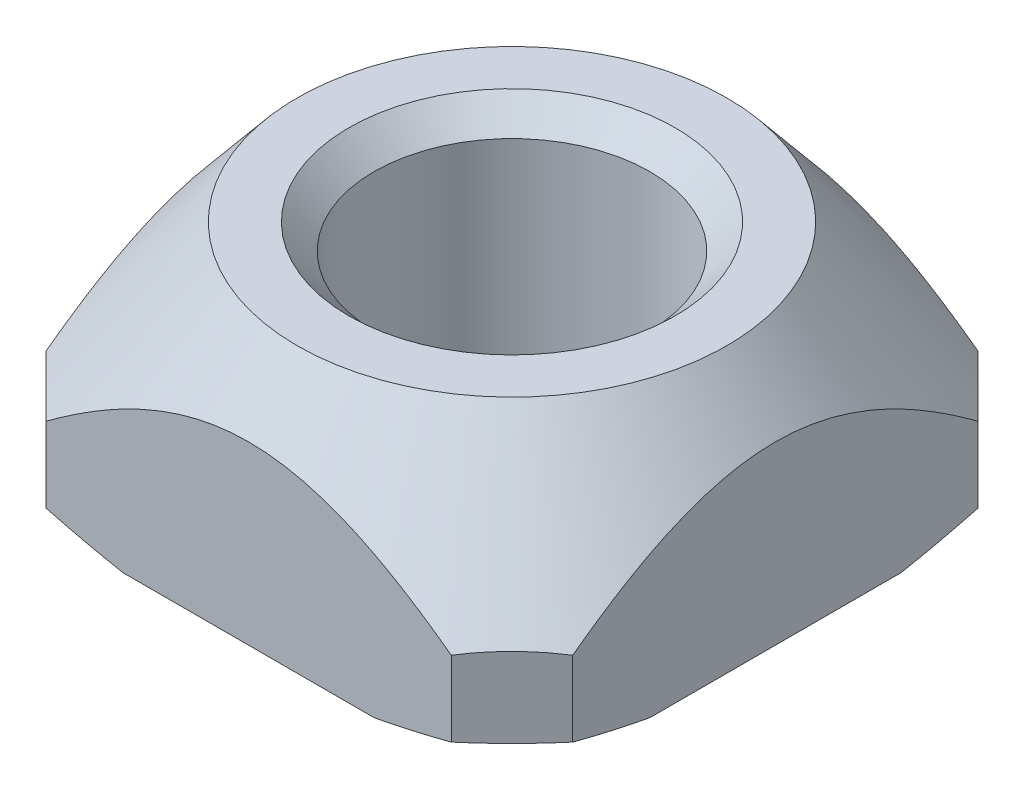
ISO-10303-21;
HEADER;
FILE_DESCRIPTION(('STEP AP214'),'2;1');
FILE_NAME('part.step','',(''),(''),'','','');
FILE_SCHEMA(('AUTOMOTIVE_DESIGN { 1 0 10303 214 1 1 1 1 }'));
ENDSEC;
DATA;
#1=APPLICATION_CONTEXT('core data for automotive mechanical design processes');
#2=APPLICATION_PROTOCOL_DEFINITION('international standard','automotive_design',2000,#1);
#3=PRODUCT_CONTEXT('',#1,'mechanical');
#4=PRODUCT('Part','Part','',(#3));
#5=PRODUCT_RELATED_PRODUCT_CATEGORY('part','',(#4));
#6=PRODUCT_DEFINITION_FORMATION('','',#4);
#7=PRODUCT_DEFINITION_CONTEXT('part definition',#1,'design');
#8=PRODUCT_DEFINITION('design','',#6,#7);
#9=PRODUCT_DEFINITION_SHAPE('','',#8);
#10=(LENGTH_UNIT() NAMED_UNIT(*) SI_UNIT(.MILLI.,.METRE.));
#11=(NAMED_UNIT(*) PLANE_ANGLE_UNIT() SI_UNIT($,.RADIAN.));
#12=(NAMED_UNIT(*) SI_UNIT($,.STERADIAN.) SOLID_ANGLE_UNIT());
#13=UNCERTAINTY_MEASURE_WITH_UNIT(LENGTH_MEASURE(1.E-05),#10,'distance_accuracy_value','');
#14=(GEOMETRIC_REPRESENTATION_CONTEXT(3) GLOBAL_UNCERTAINTY_ASSIGNED_CONTEXT((#13)) GLOBAL_UNIT_ASSIGNED_CONTEXT((#10,
#11,#12)) REPRESENTATION_CONTEXT('',''));
#15=CARTESIAN_POINT('',(0.,0.,0.));
#16=DIRECTION('',(0.,0.,1.));
#17=DIRECTION('',(1.,0.,0.));
#18=AXIS2_PLACEMENT_3D('',#15,#16,#17);
#19=CARTESIAN_POINT('',(0.,5.8,0.));
#20=DIRECTION('',(0.,-1.,0.));
#21=DIRECTION('',(0.,0.,-1.));
#22=AXIS2_PLACEMENT_3D('',#19,#20,#21);
#23=PLANE('',#22);
#24=CARTESIAN_POINT('',(0.,5.8,0.));
#25=DIRECTION('',(0.,-1.,0.));
#26=DIRECTION('',(0.,0.,-1.));
#27=AXIS2_PLACEMENT_3D('',#24,#25,#26);
#28=CIRCLE('',#27,5.3);
#29=CARTESIAN_POINT('',(0.,5.8,-5.3));
#30=VERTEX_POINT('',#29);
#31=EDGE_CURVE('E445',#30,#30,#28,.T.);
#32=ORIENTED_EDGE('',*,*,#31,.F.);
#33=EDGE_LOOP('',(#32));
#34=FACE_BOUND('',#33,.T.);
#35=CARTESIAN_POINT('',(0.,5.80000000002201,0.));
#36=DIRECTION('',(0.,1.,0.));
#37=DIRECTION('',(0.,0.,1.));
#38=AXIS2_PLACEMENT_3D('',#35,#36,#37);
#39=CIRCLE('',#38,4.02499999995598);
#40=CARTESIAN_POINT('',(0.,5.80000000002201,4.02499999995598));
#41=VERTEX_POINT('',#40);
#42=EDGE_CURVE('E19',#41,#41,#39,.F.);
#43=ORIENTED_EDGE('',*,*,#42,.T.);
#44=EDGE_LOOP('',(#43));
#45=FACE_BOUND('',#44,.T.);
#46=ADVANCED_FACE('F16',(#34,#45),#23,.F.);
#47=CARTESIAN_POINT('',(0.,5.80000000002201,0.));
#48=DIRECTION('',(0.,1.,0.));
#49=DIRECTION('',(0.,0.,1.));
#50=AXIS2_PLACEMENT_3D('',#47,#48,#49);
#51=CONICAL_SURFACE('',#50,4.02499999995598,0.785398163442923);
#52=ORIENTED_EDGE('',*,*,#42,.F.);
#53=EDGE_LOOP('',(#52));
#54=FACE_BOUND('',#53,.T.);
#55=CARTESIAN_POINT('',(0.,5.175,0.));
#56=DIRECTION('',(0.,1.,0.));
#57=DIRECTION('',(0.,0.,1.));
#58=AXIS2_PLACEMENT_3D('',#55,#56,#57);
#59=CIRCLE('',#58,3.4);
#60=CARTESIAN_POINT('',(0.,5.175,3.4));
#61=VERTEX_POINT('',#60);
#62=EDGE_CURVE('E147',#61,#61,#59,.F.);
#63=ORIENTED_EDGE('',*,*,#62,.T.);
#64=EDGE_LOOP('',(#63));
#65=FACE_BOUND('',#64,.T.);
#66=ADVANCED_FACE('F355',(#54,#65),#51,.F.);
#67=CARTESIAN_POINT('',(5.00093362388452,37.1474583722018,-6.5));
#68=DIRECTION('',(0.707106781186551,0.,-0.707106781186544));
#69=DIRECTION('',(-0.707106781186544,0.,-0.707106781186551));
#70=AXIS2_PLACEMENT_3D('',#67,#68,#69);
#71=PLANE('',#70);
#72=DIRECTION('',(0.,1.,0.));
#73=VECTOR('',#72,1.);
#74=CARTESIAN_POINT('',(5.00093362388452,5.8,-6.5));
#75=LINE('',#74,#73);
#76=CARTESIAN_POINT('',(5.00093356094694,0.429511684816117,-6.50000006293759));
#77=VERTEX_POINT('',#76);
#78=CARTESIAN_POINT('',(5.00093364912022,2.28669481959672,-6.49999997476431));
#79=VERTEX_POINT('',#78);
#80=EDGE_CURVE('E108',#77,#79,#75,.T.);
#81=ORIENTED_EDGE('',*,*,#80,.T.);
#82=CARTESIAN_POINT('',(6.50000003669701,2.28669480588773,-5.0009335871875));
#83=CARTESIAN_POINT('',(6.43784742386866,2.30045539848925,-5.06308620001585));
#84=CARTESIAN_POINT('',(6.37551621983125,2.31256643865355,-5.12541740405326));
#85=CARTESIAN_POINT('',(6.25056780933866,2.33340084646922,-5.25036581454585));
#86=CARTESIAN_POINT('',(6.18795058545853,2.34212400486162,-5.31298303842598));
#87=CARTESIAN_POINT('',(6.00058150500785,2.36298820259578,-5.50035211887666));
#88=CARTESIAN_POINT('',(5.87552418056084,2.36999999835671,-5.62540944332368));
#89=CARTESIAN_POINT('',(5.62540953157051,2.3700000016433,-5.87552409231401));
#90=CARTESIAN_POINT('',(5.5003522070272,2.36298820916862,-6.00058141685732));
#91=CARTESIAN_POINT('',(5.31298312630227,2.34212401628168,-6.18795049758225));
#92=CARTESIAN_POINT('',(5.25036590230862,2.33340085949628,-6.25056772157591));
#93=CARTESIAN_POINT('',(5.12541749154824,2.31256645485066,-6.37551613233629));
#94=CARTESIAN_POINT('',(5.06308628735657,2.30045541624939,-6.43784733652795));
#95=CARTESIAN_POINT('',(5.00093367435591,2.28669482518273,-6.49999994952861));
#96=B_SPLINE_CURVE_WITH_KNOTS('',3,(#82,#83,#84,#85,#86,#87,#88,#89,#90,#91,#92,#93,#94,#95),
.UNSPECIFIED.,.F.,.F.,(4,2,2,2,2,2,4),(0.,0.26687453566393,0.533765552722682,1.06417199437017,
1.59457843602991,1.86146945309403,2.12834398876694),.UNSPECIFIED.);
#97=CARTESIAN_POINT('',(6.5000000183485,2.28669481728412,-5.00093359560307));
#98=VERTEX_POINT('',#97);
#99=EDGE_CURVE('E101',#98,#79,#96,.T.);
#100=ORIENTED_EDGE('',*,*,#99,.F.);
#101=DIRECTION('',(0.,1.,0.));
#102=VECTOR('',#101,1.);
#103=CARTESIAN_POINT('',(6.5,5.8,-5.00093362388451));
#104=LINE('',#103,#102);
#105=CARTESIAN_POINT('',(6.50000003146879,0.429511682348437,-5.00093359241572));
#106=VERTEX_POINT('',#105);
#107=EDGE_CURVE('E106',#98,#106,#104,.F.);
#108=ORIENTED_EDGE('',*,*,#107,.T.);
#109=CARTESIAN_POINT('',(5.00093349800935,0.429511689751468,-6.50000012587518));
#110=CARTESIAN_POINT('',(5.12577543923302,0.419709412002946,-6.37515818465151));
#111=CARTESIAN_POINT('',(5.25071389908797,0.412329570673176,-6.25021972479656));
#112=CARTESIAN_POINT('',(5.50059054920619,0.402476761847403,-6.00034307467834));
#113=CARTESIAN_POINT('',(5.62552866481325,0.400000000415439,-5.87540495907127));
#114=CARTESIAN_POINT('',(5.8754048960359,0.399999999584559,-5.62552872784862));
#115=CARTESIAN_POINT('',(6.00034301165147,0.40247676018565,-5.50059061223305));
#116=CARTESIAN_POINT('',(6.25021966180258,0.412329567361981,-5.25071396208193));
#117=CARTESIAN_POINT('',(6.37515812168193,0.419709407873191,-5.12577550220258));
#118=CARTESIAN_POINT('',(6.50000006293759,0.429511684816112,-5.00093356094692));
#119=B_SPLINE_CURVE_WITH_KNOTS('',3,(#109,#110,#111,#112,#113,#114,#115,#116,#117,#118),
.UNSPECIFIED.,.F.,.F.,(4,2,2,2,4),(0.,0.530461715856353,1.06051280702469,1.59056389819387,
2.12102561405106),.UNSPECIFIED.);
#120=EDGE_CURVE('E138',#77,#106,#119,.T.);
#121=ORIENTED_EDGE('',*,*,#120,.F.);
#122=EDGE_LOOP('',(#81,#100,#108,#121));
#123=FACE_BOUND('',#122,.T.);
#124=ADVANCED_FACE('F103',(#123),#71,.T.);
#125=CARTESIAN_POINT('',(6.50000000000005,29.8974583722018,5.00093362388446));
#126=DIRECTION('',(0.707106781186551,0.,0.707106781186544));
#127=DIRECTION('',(0.707106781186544,0.,-0.707106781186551));
#128=AXIS2_PLACEMENT_3D('',#125,#126,#127);
#129=PLANE('',#128);
#130=DIRECTION('',(0.,1.,0.));
#131=VECTOR('',#130,1.);
#132=CARTESIAN_POINT('',(6.5,5.8,5.00093362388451));
#133=LINE('',#132,#131);
#134=CARTESIAN_POINT('',(6.50000006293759,0.429511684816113,5.00093356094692));
#135=VERTEX_POINT('',#134);
#136=CARTESIAN_POINT('',(6.5,2.28669481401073,5.00093362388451));
#137=VERTEX_POINT('',#136);
#138=EDGE_CURVE('E120',#135,#137,#133,.T.);
#139=ORIENTED_EDGE('',*,*,#138,.T.);
#140=CARTESIAN_POINT('',(6.5,2.28669481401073,5.00093362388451));
#141=CARTESIAN_POINT('',(6.43784738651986,2.30045540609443,5.06308623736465));
#142=CARTESIAN_POINT('',(6.37551618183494,2.31256644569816,5.12541744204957));
#143=CARTESIAN_POINT('',(6.25056777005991,2.33340085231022,5.25036585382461));
#144=CARTESIAN_POINT('',(6.18795054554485,2.34212401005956,5.31298307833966));
#145=CARTESIAN_POINT('',(6.00058146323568,2.36298820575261,5.50035216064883));
#146=CARTESIAN_POINT('',(5.87552413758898,2.37,5.62540948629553));
#147=CARTESIAN_POINT('',(5.62540948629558,2.37,5.87552413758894));
#148=CARTESIAN_POINT('',(5.50035216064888,2.36298820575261,6.00058146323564));
#149=CARTESIAN_POINT('',(5.31298307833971,2.34212401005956,6.18795054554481));
#150=CARTESIAN_POINT('',(5.25036585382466,2.33340085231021,6.25056777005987));
#151=CARTESIAN_POINT('',(5.12541744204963,2.31256644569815,6.3755161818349));
#152=CARTESIAN_POINT('',(5.0630862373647,2.30045540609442,6.43784738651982));
#153=CARTESIAN_POINT('',(5.00093362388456,2.28669481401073,6.49999999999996));
#154=B_SPLINE_CURVE_WITH_KNOTS('',3,(#140,#141,#142,#143,#144,#145,#146,#147,#148,#149,#150,
#151,#152,#153),.UNSPECIFIED.,.F.,.F.,(4,2,2,2,2,2,4),(0.,0.266874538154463,0.533765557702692,
1.06417200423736,1.59457845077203,1.86146947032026,2.12834400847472),.UNSPECIFIED.);
#155=CARTESIAN_POINT('',(5.00093362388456,2.28669481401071,6.49999999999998));
#156=VERTEX_POINT('',#155);
#157=EDGE_CURVE('E111',#137,#156,#154,.T.);
#158=ORIENTED_EDGE('',*,*,#157,.T.);
#159=DIRECTION('',(0.,1.,0.));
#160=VECTOR('',#159,1.);
#161=CARTESIAN_POINT('',(5.00093362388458,5.8,6.5));
#162=LINE('',#161,#160);
#163=CARTESIAN_POINT('',(5.00093359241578,0.429511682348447,6.50000003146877));
#164=VERTEX_POINT('',#163);
#165=EDGE_CURVE('E257',#156,#164,#162,.F.);
#166=ORIENTED_EDGE('',*,*,#165,.T.);
#167=CARTESIAN_POINT('',(6.50000012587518,0.429511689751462,5.00093349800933));
#168=CARTESIAN_POINT('',(6.37515818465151,0.419709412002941,5.125775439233));
#169=CARTESIAN_POINT('',(6.25021972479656,0.412329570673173,5.25071389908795));
#170=CARTESIAN_POINT('',(6.00034307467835,0.402476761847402,5.50059054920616));
#171=CARTESIAN_POINT('',(5.87540495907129,0.400000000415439,5.62552866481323));
#172=CARTESIAN_POINT('',(5.62552872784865,0.39999999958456,5.87540489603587));
#173=CARTESIAN_POINT('',(5.50059061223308,0.402476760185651,6.00034301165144));
#174=CARTESIAN_POINT('',(5.25071396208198,0.412329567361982,6.25021966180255));
#175=CARTESIAN_POINT('',(5.12577550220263,0.419709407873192,6.3751581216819));
#176=CARTESIAN_POINT('',(5.00093356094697,0.429511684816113,6.50000006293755));
#177=B_SPLINE_CURVE_WITH_KNOTS('',3,(#167,#168,#169,#170,#171,#172,#173,#174,#175,#176),
.UNSPECIFIED.,.F.,.F.,(4,2,2,2,4),(0.,0.530461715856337,1.06051280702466,1.59056389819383,
2.121025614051),.UNSPECIFIED.);
#178=EDGE_CURVE('E272',#135,#164,#177,.T.);
#179=ORIENTED_EDGE('',*,*,#178,.F.);
#180=EDGE_LOOP('',(#139,#158,#166,#179));
#181=FACE_BOUND('',#180,.T.);
#182=ADVANCED_FACE('F327',(#181),#129,.T.);
#183=CARTESIAN_POINT('',(0.,2.26561498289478,0.));
#184=DIRECTION('',(0.,-1.,0.));
#185=DIRECTION('',(0.,0.,-1.));
#186=AXIS2_PLACEMENT_3D('',#183,#184,#185);
#187=CONICAL_SURFACE('',#186,8.218586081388,0.690257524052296);
#188=ORIENTED_EDGE('',*,*,#31,.T.);
#189=EDGE_LOOP('',(#188));
#190=FACE_BOUND('',#189,.T.);
#191=CARTESIAN_POINT('',(-5.00093362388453,2.28669481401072,6.5));
#192=CARTESIAN_POINT('',(-5.06308623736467,2.30045540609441,6.43784738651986));
#193=CARTESIAN_POINT('',(-5.12541744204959,2.31256644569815,6.37551618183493));
#194=CARTESIAN_POINT('',(-5.25036585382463,2.33340085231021,6.2505677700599));
#195=CARTESIAN_POINT('',(-5.31298307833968,2.34212401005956,6.18795054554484));
#196=CARTESIAN_POINT('',(-5.50035216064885,2.3629882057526,6.00058146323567));
#197=CARTESIAN_POINT('',(-5.62540948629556,2.37,5.87552413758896));
#198=CARTESIAN_POINT('',(-5.87552413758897,2.37000000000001,5.62540948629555));
#199=CARTESIAN_POINT('',(-6.00058146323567,2.36298820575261,5.50035216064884));
#200=CARTESIAN_POINT('',(-6.18795054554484,2.34212401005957,5.31298307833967));
#201=CARTESIAN_POINT('',(-6.2505677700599,2.33340085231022,5.25036585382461));
#202=CARTESIAN_POINT('',(-6.37551618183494,2.31256644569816,5.12541744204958));
#203=CARTESIAN_POINT('',(-6.43784738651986,2.30045540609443,5.06308623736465));
#204=CARTESIAN_POINT('',(-6.5,2.28669481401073,5.00093362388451));
#205=B_SPLINE_CURVE_WITH_KNOTS('',3,(#191,#192,#193,#194,#195,#196,#197,#198,#199,#200,#201,
#202,#203,#204),.UNSPECIFIED.,.F.,.F.,(4,2,2,2,2,2,4),(0.,0.26687453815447,0.533765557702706,
1.06417200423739,1.59457845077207,1.8614694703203,2.12834400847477),.UNSPECIFIED.);
#206=CARTESIAN_POINT('',(-5.00093362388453,2.28669481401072,6.5));
#207=VERTEX_POINT('',#206);
#208=CARTESIAN_POINT('',(-6.5,2.28669481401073,5.00093362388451));
#209=VERTEX_POINT('',#208);
#210=EDGE_CURVE('E333',#207,#209,#205,.T.);
#211=ORIENTED_EDGE('',*,*,#210,.F.);
#212=CARTESIAN_POINT('',(-5.00093362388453,2.28669481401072,6.5));
#213=CARTESIAN_POINT('',(-4.89461882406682,2.36519488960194,6.5));
#214=CARTESIAN_POINT('',(-4.78756060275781,2.44268666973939,6.5));
#215=CARTESIAN_POINT('',(-4.57178170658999,2.59536506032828,6.5));
#216=CARTESIAN_POINT('',(-4.46306069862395,2.67055119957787,6.5));
#217=CARTESIAN_POINT('',(-4.13342181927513,2.89269870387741,6.5));
#218=CARTESIAN_POINT('',(-3.90978571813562,3.03568366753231,6.5));
#219=CARTESIAN_POINT('',(-3.4465789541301,3.31215846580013,6.5));
#220=CARTESIAN_POINT('',(-3.20672602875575,3.44517986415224,6.5));
#221=CARTESIAN_POINT('',(-2.7170779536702,3.69103259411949,6.5));
#222=CARTESIAN_POINT('',(-2.46729714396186,3.80389183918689,6.5));
#223=CARTESIAN_POINT('',(-2.03482702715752,3.97262521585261,6.5));
#224=CARTESIAN_POINT('',(-1.85483896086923,4.03539099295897,6.5));
#225=CARTESIAN_POINT('',(-1.49011877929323,4.14544511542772,6.5));
#226=CARTESIAN_POINT('',(-1.30538676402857,4.19273378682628,6.5));
#227=CARTESIAN_POINT('',(-0.934834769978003,4.26884620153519,6.5));
#228=CARTESIAN_POINT('',(-0.749067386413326,4.29792233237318,6.5));
#229=CARTESIAN_POINT('',(-0.375528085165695,4.33690000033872,6.5));
#230=CARTESIAN_POINT('',(-0.187756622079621,4.34680579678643,6.5));
#231=CARTESIAN_POINT('',(0.16789069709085,4.34681251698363,6.5));
#232=CARTESIAN_POINT('',(0.335769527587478,4.33889803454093,6.5));
#233=CARTESIAN_POINT('',(0.670076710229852,4.30766815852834,6.5));
#234=CARTESIAN_POINT('',(0.836505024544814,4.28435236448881,6.5));
#235=CARTESIAN_POINT('',(1.16887468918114,4.22305769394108,6.5));
#236=CARTESIAN_POINT('',(1.3347807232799,4.18488964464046,6.5));
#237=CARTESIAN_POINT('',(1.66300269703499,4.09557989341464,6.5));
#238=CARTESIAN_POINT('',(1.82531875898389,4.04443863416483,6.5));
#239=CARTESIAN_POINT('',(2.26283278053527,3.88965064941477,6.5));
#240=CARTESIAN_POINT('',(2.53410341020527,3.77489830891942,6.5));
#241=CARTESIAN_POINT('',(3.06513239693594,3.5205626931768,6.5));
#242=CARTESIAN_POINT('',(3.32486424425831,3.38092559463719,6.5));
#243=CARTESIAN_POINT('',(3.702501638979,3.16031756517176,6.5));
#244=CARTESIAN_POINT('',(3.82449988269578,3.08620976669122,6.5));
#245=CARTESIAN_POINT('',(4.06621203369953,2.93433161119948,6.5));
#246=CARTESIAN_POINT('',(4.18592578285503,2.85656100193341,6.5));
#247=CARTESIAN_POINT('',(4.422624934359,2.69829475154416,6.5));
#248=CARTESIAN_POINT('',(4.53962131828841,2.6178154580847,6.5));
#249=CARTESIAN_POINT('',(4.77167680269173,2.45417264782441,6.5));
#250=CARTESIAN_POINT('',(4.88673641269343,2.37100985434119,6.5));
#251=CARTESIAN_POINT('',(5.00093362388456,2.2866948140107,6.5));
#252=B_SPLINE_CURVE_WITH_KNOTS('',3,(#212,#213,#214,#215,#216,#217,#218,#219,#220,#221,#222,
#223,#224,#225,#226,#227,#228,#229,#230,#231,#232,#233,#234,#235,#236,#237,#238,#239,#240,#241,
#242,#243,#244,#245,#246,#247,#248,#249,#250,#251),.UNSPECIFIED.,.F.,.F.,(4,2,2,2,2,2,2,2,2,2,2,
2,2,2,2,2,2,2,2,4),(0.,0.396455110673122,0.792990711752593,1.58889552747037,2.41103939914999,
3.23203608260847,3.80332089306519,4.37459366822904,4.93776368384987,5.50080855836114,
6.00427946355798,6.50776346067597,7.01788207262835,7.52798328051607,8.40977024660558,
9.29348810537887,9.72166656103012,10.1498745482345,10.5758468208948,11.0017052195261),.UNSPECIFIED.);
#253=EDGE_CURVE('E258',#207,#156,#252,.T.);
#254=ORIENTED_EDGE('',*,*,#253,.T.);
#255=ORIENTED_EDGE('',*,*,#157,.F.);
#256=CARTESIAN_POINT('',(6.5,2.28669481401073,5.00093362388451));
#257=CARTESIAN_POINT('',(6.5,2.36546542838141,4.89425230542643));
#258=CARTESIAN_POINT('',(6.5,2.44322075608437,4.78682264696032));
#259=CARTESIAN_POINT('',(6.5,2.59640967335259,4.57028828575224));
#260=CARTESIAN_POINT('',(6.5,2.67184277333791,4.46118323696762));
#261=CARTESIAN_POINT('',(6.5,2.89472597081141,4.13033374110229));
#262=CARTESIAN_POINT('',(6.5,3.03816727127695,3.90584895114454));
#263=CARTESIAN_POINT('',(6.5,3.31446263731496,3.44248350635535));
#264=CARTESIAN_POINT('',(6.5,3.44694761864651,3.20338079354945));
#265=CARTESIAN_POINT('',(6.5,3.69182258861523,2.71532773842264));
#266=CARTESIAN_POINT('',(6.5,3.80424366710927,2.46639337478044));
#267=CARTESIAN_POINT('',(6.5,3.96403148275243,2.05685433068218));
#268=CARTESIAN_POINT('',(6.5,4.01970687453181,1.89949160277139));
#269=CARTESIAN_POINT('',(6.5,4.11943260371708,1.58107070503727));
#270=CARTESIAN_POINT('',(6.5,4.16348252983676,1.42001240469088));
#271=CARTESIAN_POINT('',(6.5,4.23795252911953,1.09621460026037));
#272=CARTESIAN_POINT('',(6.5,4.26848771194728,0.93350186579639));
#273=CARTESIAN_POINT('',(6.5,4.31512465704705,0.606006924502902));
#274=CARTESIAN_POINT('',(6.5,4.33122767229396,0.441224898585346));
#275=CARTESIAN_POINT('',(6.5,4.34827314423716,0.109455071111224));
#276=CARTESIAN_POINT('',(6.5,4.34908501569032,-0.0575395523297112));
#277=CARTESIAN_POINT('',(6.5,4.33517110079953,-0.390873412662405));
#278=CARTESIAN_POINT('',(6.5,4.32044494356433,-0.557212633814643));
#279=CARTESIAN_POINT('',(6.5,4.2761251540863,-0.88848991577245));
#280=CARTESIAN_POINT('',(6.5,4.24647760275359,-1.05342067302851));
#281=CARTESIAN_POINT('',(6.5,4.17365597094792,-1.3802445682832));
#282=CARTESIAN_POINT('',(6.5,4.13047995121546,-1.54213726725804));
#283=CARTESIAN_POINT('',(6.5,4.00941900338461,-1.93674499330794));
#284=CARTESIAN_POINT('',(6.5,3.92473121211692,-2.16737187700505));
#285=CARTESIAN_POINT('',(6.5,3.73524387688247,-2.62020320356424));
#286=CARTESIAN_POINT('',(6.5,3.6304297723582,-2.84240140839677));
#287=CARTESIAN_POINT('',(6.5,3.40508735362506,-3.27921361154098));
#288=CARTESIAN_POINT('',(6.5,3.2845244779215,-3.49380956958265));
#289=CARTESIAN_POINT('',(6.5,3.03152298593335,-3.91571764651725));
#290=CARTESIAN_POINT('',(6.5,2.89908838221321,-4.12303219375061));
#291=CARTESIAN_POINT('',(6.5,2.68529870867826,-4.44159950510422));
#292=CARTESIAN_POINT('',(6.5,2.60709917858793,-4.55499497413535));
#293=CARTESIAN_POINT('',(6.5,2.44851798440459,-4.77950010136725));
#294=CARTESIAN_POINT('',(6.5,2.36814750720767,-4.89061765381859));
#295=CARTESIAN_POINT('',(6.5,2.28669482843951,-5.00093360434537));
#296=B_SPLINE_CURVE_WITH_KNOTS('',3,(#256,#257,#258,#259,#260,#261,#262,#263,#264,#265,#266,
#267,#268,#269,#270,#271,#272,#273,#274,#275,#276,#277,#278,#279,#280,#281,#282,#283,#284,#285,
#286,#287,#288,#289,#290,#291,#292,#293,#294,#295),.UNSPECIFIED.,.F.,.F.,(4,2,2,2,2,2,2,2,2,2,2,
2,2,2,2,2,2,2,2,4),(0.,0.39782125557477,0.795725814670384,1.59450470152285,2.41391220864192,
3.23203877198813,3.7324336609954,4.23284625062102,4.72891053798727,5.22493175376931,
5.72518705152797,6.22545429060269,6.727542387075,7.2297024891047,7.96546321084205,
8.70175824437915,9.43969714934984,10.1773875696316,10.590593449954,11.0019709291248),.UNSPECIFIED.);
#297=EDGE_CURVE('E113',#137,#98,#296,.T.);
#298=ORIENTED_EDGE('',*,*,#297,.T.);
#299=ORIENTED_EDGE('',*,*,#99,.T.);
#300=CARTESIAN_POINT('',(5.00093365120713,2.28669479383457,-6.5));
#301=CARTESIAN_POINT('',(4.89461885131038,2.36519486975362,-6.5));
#302=CARTESIAN_POINT('',(4.78756062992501,2.442686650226,-6.5));
#303=CARTESIAN_POINT('',(4.57178173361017,2.59536504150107,-6.5));
#304=CARTESIAN_POINT('',(4.46306072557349,2.67055118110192,-6.5));
#305=CARTESIAN_POINT('',(4.13342184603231,2.89269868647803,-6.5));
#306=CARTESIAN_POINT('',(3.90978574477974,3.03568365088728,-6.5));
#307=CARTESIAN_POINT('',(3.44657898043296,3.31215845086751,-6.5));
#308=CARTESIAN_POINT('',(3.20672605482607,3.44517985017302,-6.5));
#309=CARTESIAN_POINT('',(2.71707797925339,3.69103258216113,-6.5));
#310=CARTESIAN_POINT('',(2.46729716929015,3.80389182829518,-6.5));
#311=CARTESIAN_POINT('',(2.03482705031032,3.97262520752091,-6.5));
#312=CARTESIAN_POINT('',(1.85483898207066,4.0353909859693,-6.5));
#313=CARTESIAN_POINT('',(1.49011879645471,4.1454451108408,-6.5));
#314=CARTESIAN_POINT('',(1.30538677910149,4.19273378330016,-6.5));
#315=CARTESIAN_POINT('',(0.934834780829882,4.26884619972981,-6.5));
#316=CARTESIAN_POINT('',(0.749067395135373,4.29792233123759,-6.5));
#317=CARTESIAN_POINT('',(0.37552808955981,4.33690000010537,-6.5));
#318=CARTESIAN_POINT('',(0.18775662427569,4.34680579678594,-6.5));
#319=CARTESIAN_POINT('',(-0.167890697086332,4.34681251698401,-6.5));
#320=CARTESIAN_POINT('',(-0.335769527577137,4.33889803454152,-6.5));
#321=CARTESIAN_POINT('',(-0.67007671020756,4.30766815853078,-6.5));
#322=CARTESIAN_POINT('',(-0.836505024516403,4.28435236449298,-6.5));
#323=CARTESIAN_POINT('',(-1.16887468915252,4.22305769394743,-6.5));
#324=CARTESIAN_POINT('',(-1.33478072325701,4.1848896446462,-6.5));
#325=CARTESIAN_POINT('',(-1.66300269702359,4.09557989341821,-6.5));
#326=CARTESIAN_POINT('',(-1.82531875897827,4.04443863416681,-6.5));
#327=CARTESIAN_POINT('',(-2.26283278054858,3.88965064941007,-6.5));
#328=CARTESIAN_POINT('',(-2.53410341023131,3.77489830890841,-6.5));
#329=CARTESIAN_POINT('',(-3.06513239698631,3.52056269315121,-6.5));
#330=CARTESIAN_POINT('',(-3.32486424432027,3.38092559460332,-6.5));
#331=CARTESIAN_POINT('',(-3.7025016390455,3.16031756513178,-6.5));
#332=CARTESIAN_POINT('',(-3.82449988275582,3.08620976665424,-6.5));
#333=CARTESIAN_POINT('',(-4.0662120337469,2.93433161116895,-6.5));
#334=CARTESIAN_POINT('',(-4.18592578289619,2.85656100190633,-6.5));
#335=CARTESIAN_POINT('',(-4.422624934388,2.69829475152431,-6.5));
#336=CARTESIAN_POINT('',(-4.53962131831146,2.61781545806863,-6.5));
#337=CARTESIAN_POINT('',(-4.77167680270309,2.45417264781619,-6.5));
#338=CARTESIAN_POINT('',(-4.88673641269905,2.37100985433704,-6.5));
#339=CARTESIAN_POINT('',(-5.00093362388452,2.28669481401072,-6.5));
#340=B_SPLINE_CURVE_WITH_KNOTS('',3,(#300,#301,#302,#303,#304,#305,#306,#307,#308,#309,#310,
#311,#312,#313,#314,#315,#316,#317,#318,#319,#320,#321,#322,#323,#324,#325,#326,#327,#328,#329,
#330,#331,#332,#333,#334,#335,#336,#337,#338,#339),.UNSPECIFIED.,.F.,.F.,(4,2,2,2,2,2,2,2,2,2,2,
2,2,2,2,2,2,2,2,4),(0.,0.396455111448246,0.792990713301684,1.5888955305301,2.41103940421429,
3.23203608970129,3.80332090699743,4.37459368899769,4.93776371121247,5.50080859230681,
6.00427949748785,6.50776349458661,7.01788210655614,7.52798331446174,8.40977028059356,
9.29348813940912,9.72166659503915,10.1498745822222,10.5758468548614,11.0017052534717),.UNSPECIFIED.);
#341=CARTESIAN_POINT('',(-5.00093362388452,2.28669481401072,-6.5));
#342=VERTEX_POINT('',#341);
#343=EDGE_CURVE('E144',#79,#342,#340,.T.);
#344=ORIENTED_EDGE('',*,*,#343,.T.);
#345=CARTESIAN_POINT('',(-6.5,2.28669481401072,-5.00093362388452));
#346=CARTESIAN_POINT('',(-6.43784738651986,2.30045540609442,-5.06308623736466));
#347=CARTESIAN_POINT('',(-6.37551618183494,2.31256644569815,-5.12541744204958));
#348=CARTESIAN_POINT('',(-6.2505677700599,2.33340085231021,-5.25036585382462));
#349=CARTESIAN_POINT('',(-6.18795054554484,2.34212401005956,-5.31298307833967));
#350=CARTESIAN_POINT('',(-6.00058146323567,2.36298820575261,-5.50035216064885));
#351=CARTESIAN_POINT('',(-5.87552413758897,2.37,-5.62540948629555));
#352=CARTESIAN_POINT('',(-5.62540948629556,2.37000000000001,-5.87552413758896));
#353=CARTESIAN_POINT('',(-5.50035216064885,2.36298820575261,-6.00058146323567));
#354=CARTESIAN_POINT('',(-5.31298307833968,2.34212401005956,-6.18795054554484));
#355=CARTESIAN_POINT('',(-5.25036585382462,2.33340085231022,-6.2505677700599));
#356=CARTESIAN_POINT('',(-5.12541744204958,2.31256644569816,-6.37551618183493));
#357=CARTESIAN_POINT('',(-5.06308623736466,2.30045540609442,-6.43784738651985));
#358=CARTESIAN_POINT('',(-5.00093362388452,2.28669481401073,-6.5));
#359=B_SPLINE_CURVE_WITH_KNOTS('',3,(#345,#346,#347,#348,#349,#350,#351,#352,#353,#354,#355,
#356,#357,#358),.UNSPECIFIED.,.F.,.F.,(4,2,2,2,2,2,4),(0.,0.26687453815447,0.533765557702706,
1.06417200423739,1.59457845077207,1.8614694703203,2.12834400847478),.UNSPECIFIED.);
#360=CARTESIAN_POINT('',(-6.5,2.28669481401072,-5.00093362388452));
#361=VERTEX_POINT('',#360);
#362=EDGE_CURVE('E150',#361,#342,#359,.T.);
#363=ORIENTED_EDGE('',*,*,#362,.F.);
#364=CARTESIAN_POINT('',(-6.5,2.28669481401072,-5.00093362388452));
#365=CARTESIAN_POINT('',(-6.5,2.36546542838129,-4.89425230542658));
#366=CARTESIAN_POINT('',(-6.5,2.44322075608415,-4.78682264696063));
#367=CARTESIAN_POINT('',(-6.5,2.59640967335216,-4.57028828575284));
#368=CARTESIAN_POINT('',(-6.5,2.67184277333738,-4.46118323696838));
#369=CARTESIAN_POINT('',(-6.5,2.89472597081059,-4.13033374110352));
#370=CARTESIAN_POINT('',(-6.5,3.03816727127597,-3.90584895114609));
#371=CARTESIAN_POINT('',(-6.5,3.31446263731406,-3.44248350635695));
#372=CARTESIAN_POINT('',(-6.5,3.44694761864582,-3.20338079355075));
#373=CARTESIAN_POINT('',(-6.5,3.69182258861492,-2.71532773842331));
#374=CARTESIAN_POINT('',(-6.5,3.80424366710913,-2.46639337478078));
#375=CARTESIAN_POINT('',(-6.5,3.96403148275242,-2.05685433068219));
#376=CARTESIAN_POINT('',(-6.5,4.0197068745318,-1.89949160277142));
#377=CARTESIAN_POINT('',(-6.5,4.11943260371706,-1.58107070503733));
#378=CARTESIAN_POINT('',(-6.5,4.16348252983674,-1.42001240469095));
#379=CARTESIAN_POINT('',(-6.5,4.23795252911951,-1.09621460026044));
#380=CARTESIAN_POINT('',(-6.5,4.26848771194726,-0.933501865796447));
#381=CARTESIAN_POINT('',(-6.5,4.31512465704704,-0.606006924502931));
#382=CARTESIAN_POINT('',(-6.5,4.33122767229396,-0.441224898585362));
#383=CARTESIAN_POINT('',(-6.5,4.34827314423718,-0.109455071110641));
#384=CARTESIAN_POINT('',(-6.5,4.34908501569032,0.0575395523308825));
#385=CARTESIAN_POINT('',(-6.5,4.33517110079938,0.390873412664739));
#386=CARTESIAN_POINT('',(-6.5,4.32044494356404,0.557212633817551));
#387=CARTESIAN_POINT('',(-6.5,4.2761251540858,0.888489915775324));
#388=CARTESIAN_POINT('',(-6.5,4.24647760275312,1.05342067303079));
#389=CARTESIAN_POINT('',(-6.5,4.17365597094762,1.38024456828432));
#390=CARTESIAN_POINT('',(-6.5,4.13047995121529,1.5421372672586));
#391=CARTESIAN_POINT('',(-6.5,4.00941900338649,1.93674499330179));
#392=CARTESIAN_POINT('',(-6.5,3.92473121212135,2.16737187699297));
#393=CARTESIAN_POINT('',(-6.5,3.73524387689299,2.62020320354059));
#394=CARTESIAN_POINT('',(-6.5,3.63042977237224,2.8424014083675));
#395=CARTESIAN_POINT('',(-6.5,3.40508735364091,3.2792136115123));
#396=CARTESIAN_POINT('',(-6.5,3.2845244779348,3.49380956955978));
#397=CARTESIAN_POINT('',(-6.5,3.03152298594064,3.91571764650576));
#398=CARTESIAN_POINT('',(-6.5,2.89908838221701,4.1230321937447));
#399=CARTESIAN_POINT('',(-6.5,2.68529870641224,4.44159950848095));
#400=CARTESIAN_POINT('',(-6.5,2.6070991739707,4.55499498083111));
#401=CARTESIAN_POINT('',(-6.5,2.44851797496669,4.77950011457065));
#402=CARTESIAN_POINT('',(-6.5,2.36814749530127,4.89061767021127));
#403=CARTESIAN_POINT('',(-6.5,2.28669481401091,5.00093362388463));
#404=B_SPLINE_CURVE_WITH_KNOTS('',3,(#364,#365,#366,#367,#368,#369,#370,#371,#372,#373,#374,
#375,#376,#377,#378,#379,#380,#381,#382,#383,#384,#385,#386,#387,#388,#389,#390,#391,#392,#393,
#394,#395,#396,#397,#398,#399,#400,#401,#402,#403),.UNSPECIFIED.,.F.,.F.,(4,2,2,2,2,2,2,2,2,2,2,
2,2,2,2,2,2,2,2,4),(0.,0.397821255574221,0.795725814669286,1.59450470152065,2.41391220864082,
3.23203877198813,3.73243366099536,4.23284625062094,4.72891053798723,5.22493175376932,
5.72518705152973,6.2254542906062,6.72754238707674,7.22970248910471,7.96546321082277,
8.70175824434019,9.43969714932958,10.1773875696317,10.5905934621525,11.0019709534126),.UNSPECIFIED.);
#405=EDGE_CURVE('E218',#361,#209,#404,.T.);
#406=ORIENTED_EDGE('',*,*,#405,.T.);
#407=EDGE_LOOP('',(#211,#254,#255,#298,#299,#344,#363,#406));
#408=FACE_BOUND('',#407,.T.);
#409=ADVANCED_FACE('F115',(#190,#408),#187,.T.);
#410=CARTESIAN_POINT('',(-5.00093362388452,29.8974583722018,6.5));
#411=DIRECTION('',(-0.707106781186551,0.,0.707106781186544));
#412=DIRECTION('',(0.707106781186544,0.,0.707106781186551));
#413=AXIS2_PLACEMENT_3D('',#410,#411,#412);
#414=PLANE('',#413);
#415=DIRECTION('',(0.,1.,0.));
#416=VECTOR('',#415,1.);
#417=CARTESIAN_POINT('',(-5.00093362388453,5.8,6.5));
#418=LINE('',#417,#416);
#419=CARTESIAN_POINT('',(-5.00093356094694,0.429511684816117,6.50000006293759));
#420=VERTEX_POINT('',#419);
#421=EDGE_CURVE('E134',#420,#207,#418,.T.);
#422=ORIENTED_EDGE('',*,*,#421,.T.);
#423=ORIENTED_EDGE('',*,*,#210,.T.);
#424=DIRECTION('',(0.,1.,0.));
#425=VECTOR('',#424,1.);
#426=CARTESIAN_POINT('',(-6.5,5.8,5.00093362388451));
#427=LINE('',#426,#425);
#428=CARTESIAN_POINT('',(-6.49999996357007,0.429511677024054,5.00093366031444));
#429=VERTEX_POINT('',#428);
#430=EDGE_CURVE('E217',#209,#429,#427,.F.);
#431=ORIENTED_EDGE('',*,*,#430,.T.);
#432=CARTESIAN_POINT('',(-5.00093349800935,0.429511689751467,6.50000012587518));
#433=CARTESIAN_POINT('',(-5.12577542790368,0.419709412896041,6.37515819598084));
#434=CARTESIAN_POINT('',(-5.25071387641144,0.412329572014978,6.25021974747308));
#435=CARTESIAN_POINT('',(-5.50059050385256,0.402476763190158,6.00034312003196));
#436=CARTESIAN_POINT('',(-5.62552860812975,0.400000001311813,5.87540501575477));
#437=CARTESIAN_POINT('',(-5.87540481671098,0.399999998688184,5.62552880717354));
#438=CARTESIAN_POINT('',(-6.00034292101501,0.402476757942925,5.5005907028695));
#439=CARTESIAN_POINT('',(-6.25021954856,0.412329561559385,5.25071407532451));
#440=CARTESIAN_POINT('',(-6.37515799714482,0.419709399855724,5.12577562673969));
#441=CARTESIAN_POINT('',(-6.49999992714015,0.429511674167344,5.00093369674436));
#442=B_SPLINE_CURVE_WITH_KNOTS('',3,(#432,#433,#434,#435,#436,#437,#438,#439,#440,#441),
.UNSPECIFIED.,.F.,.F.,(4,2,2,2,4),(0.,0.530461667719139,1.0605127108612,1.5905637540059,
2.12102542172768),.UNSPECIFIED.);
#443=EDGE_CURVE('E235',#420,#429,#442,.T.);
#444=ORIENTED_EDGE('',*,*,#443,.F.);
#445=EDGE_LOOP('',(#422,#423,#431,#444));
#446=FACE_BOUND('',#445,.T.);
#447=ADVANCED_FACE('F326',(#446),#414,.T.);
#448=CARTESIAN_POINT('',(-6.50000000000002,29.8974583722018,-5.0009336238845));
#449=DIRECTION('',(-0.707106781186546,0.,-0.707106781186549));
#450=DIRECTION('',(-0.707106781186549,0.,0.707106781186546));
#451=AXIS2_PLACEMENT_3D('',#448,#449,#450);
#452=PLANE('',#451);
#453=DIRECTION('',(0.,1.,0.));
#454=VECTOR('',#453,1.);
#455=CARTESIAN_POINT('',(-6.5,5.8,-5.00093362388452));
#456=LINE('',#455,#454);
#457=CARTESIAN_POINT('',(-6.50000006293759,0.429511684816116,-5.00093356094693));
#458=VERTEX_POINT('',#457);
#459=EDGE_CURVE('E395',#458,#361,#456,.T.);
#460=ORIENTED_EDGE('',*,*,#459,.T.);
#461=ORIENTED_EDGE('',*,*,#362,.T.);
#462=DIRECTION('',(0.,1.,0.));
#463=VECTOR('',#462,1.);
#464=CARTESIAN_POINT('',(-5.00093362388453,5.8,-6.5));
#465=LINE('',#464,#463);
#466=CARTESIAN_POINT('',(-5.00093369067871,0.42951169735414,-6.5));
#467=VERTEX_POINT('',#466);
#468=EDGE_CURVE('E139',#342,#467,#465,.F.);
#469=ORIENTED_EDGE('',*,*,#468,.T.);
#470=CARTESIAN_POINT('',(-6.50000012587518,0.429511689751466,-5.00093349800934));
#471=CARTESIAN_POINT('',(-6.37515819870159,0.419709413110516,-5.12577542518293));
#472=CARTESIAN_POINT('',(-6.25021975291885,0.41232957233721,-5.25071387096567));
#473=CARTESIAN_POINT('',(-6.00034313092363,0.40247676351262,-5.50059049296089));
#474=CARTESIAN_POINT('',(-5.87540502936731,0.400000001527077,-5.62552859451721));
#475=CARTESIAN_POINT('',(-5.62552882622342,0.399999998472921,-5.8754047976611));
#476=CARTESIAN_POINT('',(-5.50059072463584,0.402476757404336,-6.00034289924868));
#477=CARTESIAN_POINT('',(-5.2507141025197,0.412329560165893,-6.25021952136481));
#478=CARTESIAN_POINT('',(-5.12577565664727,0.41970939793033,-6.37515796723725));
#479=CARTESIAN_POINT('',(-5.00093372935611,0.429511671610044,-6.49999989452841));
#480=B_SPLINE_CURVE_WITH_KNOTS('',3,(#470,#471,#472,#473,#474,#475,#476,#477,#478,#479),
.UNSPECIFIED.,.F.,.F.,(4,2,2,2,4),(0.,0.530461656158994,1.06051268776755,1.59056371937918,
2.12102537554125),.UNSPECIFIED.);
#481=EDGE_CURVE('E181',#458,#467,#480,.T.);
#482=ORIENTED_EDGE('',*,*,#481,.F.);
#483=EDGE_LOOP('',(#460,#461,#469,#482));
#484=FACE_BOUND('',#483,.T.);
#485=ADVANCED_FACE('F376',(#484),#452,.T.);
#486=CARTESIAN_POINT('',(0.,5.8,0.));
#487=DIRECTION('',(0.,1.,0.));
#488=DIRECTION('',(0.,0.,1.));
#489=AXIS2_PLACEMENT_3D('',#486,#487,#488);
#490=CYLINDRICAL_SURFACE('',#489,3.4);
#491=ORIENTED_EDGE('',*,*,#62,.F.);
#492=EDGE_LOOP('',(#491));
#493=FACE_BOUND('',#492,.T.);
#494=CARTESIAN_POINT('',(0.,0.,0.));
#495=DIRECTION('',(0.,1.,0.));
#496=DIRECTION('',(0.,0.,1.));
#497=AXIS2_PLACEMENT_3D('',#494,#495,#496);
#498=CIRCLE('',#497,3.4);
#499=CARTESIAN_POINT('',(0.,0.,3.4));
#500=VERTEX_POINT('',#499);
#501=EDGE_CURVE('E167',#500,#500,#498,.T.);
#502=ORIENTED_EDGE('',*,*,#501,.F.);
#503=EDGE_LOOP('',(#502));
#504=FACE_BOUND('',#503,.T.);
#505=ADVANCED_FACE('F374',(#493,#504),#490,.F.);
#506=CARTESIAN_POINT('',(-6.5,5.8,-6.5));
#507=DIRECTION('',(0.,0.,1.));
#508=DIRECTION('',(1.,0.,0.));
#509=AXIS2_PLACEMENT_3D('',#506,#507,#508);
#510=PLANE('',#509);
#511=ORIENTED_EDGE('',*,*,#468,.F.);
#512=ORIENTED_EDGE('',*,*,#343,.F.);
#513=ORIENTED_EDGE('',*,*,#80,.F.);
#514=CARTESIAN_POINT('',(3.0967725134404,0.,-6.5));
#515=CARTESIAN_POINT('',(3.25681087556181,0.0295324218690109,-6.5));
#516=CARTESIAN_POINT('',(3.41650959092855,0.0608632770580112,-6.5));
#517=CARTESIAN_POINT('',(3.73518371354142,0.126759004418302,-6.5));
#518=CARTESIAN_POINT('',(3.89415934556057,0.161322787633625,-6.5));
#519=CARTESIAN_POINT('',(4.21144082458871,0.233339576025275,-6.5));
#520=CARTESIAN_POINT('',(4.36974671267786,0.270792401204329,-6.5));
#521=CARTESIAN_POINT('',(4.68578021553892,0.3482890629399,-6.5));
#522=CARTESIAN_POINT('',(4.84350761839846,0.388333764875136,-6.5));
#523=CARTESIAN_POINT('',(5.00093343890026,0.429511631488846,-6.5));
#524=B_SPLINE_CURVE_WITH_KNOTS('',3,(#514,#515,#516,#517,#518,#519,#520,#521,#522,#523),
.UNSPECIFIED.,.F.,.F.,(4,2,2,2,4),(0.,0.488199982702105,0.97623611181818,1.46424185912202,
1.95241139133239),.UNSPECIFIED.);
#525=CARTESIAN_POINT('',(3.0967725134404,0.,-6.5));
#526=VERTEX_POINT('',#525);
#527=EDGE_CURVE('E143',#526,#77,#524,.T.);
#528=ORIENTED_EDGE('',*,*,#527,.F.);
#529=DIRECTION('',(1.,0.,0.));
#530=VECTOR('',#529,1.);
#531=CARTESIAN_POINT('',(0.,0.,-6.5));
#532=LINE('',#531,#530);
#533=CARTESIAN_POINT('',(-3.0967725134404,0.,-6.5));
#534=VERTEX_POINT('',#533);
#535=EDGE_CURVE('E166',#534,#526,#532,.T.);
#536=ORIENTED_EDGE('',*,*,#535,.F.);
#537=CARTESIAN_POINT('',(-5.00093375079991,0.429511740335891,-6.49999996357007));
#538=CARTESIAN_POINT('',(-4.84350790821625,0.388333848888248,-6.4999999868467));
#539=CARTESIAN_POINT('',(-4.68578048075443,0.348289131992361,-6.49999999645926));
#540=CARTESIAN_POINT('',(-4.36974692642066,0.270792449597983,-6.50000000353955));
#541=CARTESIAN_POINT('',(-4.21144101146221,0.233339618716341,-6.50000000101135));
#542=CARTESIAN_POINT('',(-3.89415947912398,0.16132281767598,-6.49999999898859));
#543=CARTESIAN_POINT('',(-3.73518382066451,0.126759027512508,-6.49999999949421));
#544=CARTESIAN_POINT('',(-3.41650964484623,0.0608632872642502,-6.50000000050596));
#545=CARTESIAN_POINT('',(-3.25681090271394,0.0295324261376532,-6.5000000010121));
#546=CARTESIAN_POINT('',(-3.0967725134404,0.,-6.5));
#547=B_SPLINE_CURVE_WITH_KNOTS('',3,(#537,#538,#539,#540,#541,#542,#543,#544,#545,#546),
.UNSPECIFIED.,.F.,.F.,(4,2,2,2,4),(0.,0.488169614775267,0.976175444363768,1.46421165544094,
1.95241172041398),.UNSPECIFIED.);
#548=EDGE_CURVE('E171',#467,#534,#547,.T.);
#549=ORIENTED_EDGE('',*,*,#548,.F.);
#550=EDGE_LOOP('',(#511,#512,#513,#528,#536,#549));
#551=FACE_BOUND('',#550,.T.);
#552=ADVANCED_FACE('F188',(#551),#510,.F.);
#553=CARTESIAN_POINT('',(0.,0.432088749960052,0.));
#554=DIRECTION('',(0.,1.,0.));
#555=DIRECTION('',(0.,0.,1.));
#556=AXIS2_PLACEMENT_3D('',#553,#554,#555);
#557=CONICAL_SURFACE('',#556,8.207186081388,1.1655375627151);
#558=ORIENTED_EDGE('',*,*,#527,.T.);
#559=ORIENTED_EDGE('',*,*,#120,.T.);
#560=CARTESIAN_POINT('',(6.50000003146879,0.429511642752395,-5.0009335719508));
#561=CARTESIAN_POINT('',(6.50000001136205,0.388333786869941,-4.84350773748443));
#562=CARTESIAN_POINT('',(6.50000000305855,0.348289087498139,-4.68578032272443));
#563=CARTESIAN_POINT('',(6.49999999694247,0.27079242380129,-4.36974679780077));
#564=CARTESIAN_POINT('',(6.49999999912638,0.233339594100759,-4.21144089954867));
#565=CARTESIAN_POINT('',(6.50000000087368,0.161322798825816,-3.89415939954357));
#566=CARTESIAN_POINT('',(6.50000000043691,0.126759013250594,-3.73518375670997));
#567=CARTESIAN_POINT('',(6.49999999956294,0.0608632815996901,-3.4165096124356));
#568=CARTESIAN_POINT('',(6.49999999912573,0.0295324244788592,-3.25681088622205));
#569=CARTESIAN_POINT('',(6.5,0.,-3.0967725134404));
#570=B_SPLINE_CURVE_WITH_KNOTS('',3,(#560,#561,#562,#563,#564,#565,#566,#567,#568,#569),
.UNSPECIFIED.,.F.,.F.,(4,2,2,2,4),(0.,0.488169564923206,0.976175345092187,1.46421150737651,
1.95241152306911),.UNSPECIFIED.);
#571=CARTESIAN_POINT('',(6.5,0.,-3.09677251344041));
#572=VERTEX_POINT('',#571);
#573=EDGE_CURVE('E125',#106,#572,#570,.T.);
#574=ORIENTED_EDGE('',*,*,#573,.T.);
#575=CARTESIAN_POINT('',(0.,0.,0.));
#576=DIRECTION('',(0.,1.,0.));
#577=DIRECTION('',(0.,0.,1.));
#578=AXIS2_PLACEMENT_3D('',#575,#576,#577);
#579=CIRCLE('',#578,7.2);
#580=EDGE_CURVE('E162',#526,#572,#579,.F.);
#581=ORIENTED_EDGE('',*,*,#580,.F.);
#582=EDGE_LOOP('',(#558,#559,#574,#581));
#583=FACE_BOUND('',#582,.T.);
#584=ADVANCED_FACE('F294',(#583),#557,.T.);
#585=CARTESIAN_POINT('',(6.5,5.8,6.5));
#586=DIRECTION('',(-1.,0.,0.));
#587=DIRECTION('',(0.,0.,1.));
#588=AXIS2_PLACEMENT_3D('',#585,#586,#587);
#589=PLANE('',#588);
#590=ORIENTED_EDGE('',*,*,#107,.F.);
#591=ORIENTED_EDGE('',*,*,#297,.F.);
#592=ORIENTED_EDGE('',*,*,#138,.F.);
#593=CARTESIAN_POINT('',(6.5,0.,3.09677251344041));
#594=CARTESIAN_POINT('',(6.5,0.0295324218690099,3.25681087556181));
#595=CARTESIAN_POINT('',(6.5,0.06086327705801,3.41650959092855));
#596=CARTESIAN_POINT('',(6.5,0.1267590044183,3.73518371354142));
#597=CARTESIAN_POINT('',(6.5,0.161322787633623,3.89415934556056));
#598=CARTESIAN_POINT('',(6.5,0.233339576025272,4.2114408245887));
#599=CARTESIAN_POINT('',(6.5,0.270792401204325,4.36974671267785));
#600=CARTESIAN_POINT('',(6.5,0.348289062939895,4.68578021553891));
#601=CARTESIAN_POINT('',(6.5,0.388333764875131,4.84350761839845));
#602=CARTESIAN_POINT('',(6.5,0.429511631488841,5.00093343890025));
#603=B_SPLINE_CURVE_WITH_KNOTS('',3,(#593,#594,#595,#596,#597,#598,#599,#600,#601,#602),
.UNSPECIFIED.,.F.,.F.,(4,2,2,2,4),(0.,0.488199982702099,0.976236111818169,1.46424185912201,
1.95241139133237),.UNSPECIFIED.);
#604=CARTESIAN_POINT('',(6.5,0.,3.09677251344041));
#605=VERTEX_POINT('',#604);
#606=EDGE_CURVE('E130',#605,#135,#603,.T.);
#607=ORIENTED_EDGE('',*,*,#606,.F.);
#608=DIRECTION('',(0.,0.,-1.));
#609=VECTOR('',#608,1.);
#610=CARTESIAN_POINT('',(6.5,0.,0.));
#611=LINE('',#610,#609);
#612=EDGE_CURVE('E161',#572,#605,#611,.F.);
#613=ORIENTED_EDGE('',*,*,#612,.F.);
#614=ORIENTED_EDGE('',*,*,#573,.F.);
#615=EDGE_LOOP('',(#590,#591,#592,#607,#613,#614));
#616=FACE_BOUND('',#615,.T.);
#617=ADVANCED_FACE('F123',(#616),#589,.F.);
#618=CARTESIAN_POINT('',(0.,0.432088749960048,0.));
#619=DIRECTION('',(0.,1.,0.));
#620=DIRECTION('',(0.,0.,1.));
#621=AXIS2_PLACEMENT_3D('',#618,#619,#620);
#622=CONICAL_SURFACE('',#621,8.20718608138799,1.1655375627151);
#623=ORIENTED_EDGE('',*,*,#606,.T.);
#624=ORIENTED_EDGE('',*,*,#178,.T.);
#625=CARTESIAN_POINT('',(5.00093356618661,0.429511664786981,6.5));
#626=CARTESIAN_POINT('',(4.84350773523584,0.388333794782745,6.5));
#627=CARTESIAN_POINT('',(4.68578032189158,0.348289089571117,6.5));
#628=CARTESIAN_POINT('',(4.36974679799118,0.270792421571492,6.5));
#629=CARTESIAN_POINT('',(4.21144089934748,0.233339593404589,6.5));
#630=CARTESIAN_POINT('',(3.89415939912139,0.161322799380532,6.5));
#631=CARTESIAN_POINT('',(3.73518375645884,0.126759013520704,6.5));
#632=CARTESIAN_POINT('',(3.41650961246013,0.0608632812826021,6.5));
#633=CARTESIAN_POINT('',(3.25681088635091,0.02953242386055,6.5));
#634=CARTESIAN_POINT('',(3.09677251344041,0.,6.5));
#635=B_SPLINE_CURVE_WITH_KNOTS('',3,(#625,#626,#627,#628,#629,#630,#631,#632,#633,#634),
.UNSPECIFIED.,.F.,.F.,(4,2,2,2,4),(0.,0.488169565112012,0.97617534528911,1.46421150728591,
1.95241152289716),.UNSPECIFIED.);
#636=CARTESIAN_POINT('',(3.09677251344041,0.,6.5));
#637=VERTEX_POINT('',#636);
#638=EDGE_CURVE('E250',#164,#637,#635,.T.);
#639=ORIENTED_EDGE('',*,*,#638,.T.);
#640=CARTESIAN_POINT('',(0.,0.,0.));
#641=DIRECTION('',(0.,1.,0.));
#642=DIRECTION('',(0.,0.,1.));
#643=AXIS2_PLACEMENT_3D('',#640,#641,#642);
#644=CIRCLE('',#643,7.2);
#645=EDGE_CURVE('E157',#605,#637,#644,.F.);
#646=ORIENTED_EDGE('',*,*,#645,.F.);
#647=EDGE_LOOP('',(#623,#624,#639,#646));
#648=FACE_BOUND('',#647,.T.);
#649=ADVANCED_FACE('F264',(#648),#622,.T.);
#650=CARTESIAN_POINT('',(-6.5,5.8,6.5));
#651=DIRECTION('',(0.,0.,-1.));
#652=DIRECTION('',(-1.,0.,0.));
#653=AXIS2_PLACEMENT_3D('',#650,#651,#652);
#654=PLANE('',#653);
#655=ORIENTED_EDGE('',*,*,#165,.F.);
#656=ORIENTED_EDGE('',*,*,#253,.F.);
#657=ORIENTED_EDGE('',*,*,#421,.F.);
#658=CARTESIAN_POINT('',(-3.09677251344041,0.,6.5));
#659=CARTESIAN_POINT('',(-3.25681087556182,0.0295324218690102,6.5));
#660=CARTESIAN_POINT('',(-3.41650959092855,0.0608632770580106,6.5));
#661=CARTESIAN_POINT('',(-3.73518371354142,0.126759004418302,6.5));
#662=CARTESIAN_POINT('',(-3.89415934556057,0.161322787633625,6.5));
#663=CARTESIAN_POINT('',(-4.21144082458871,0.233339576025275,6.5));
#664=CARTESIAN_POINT('',(-4.36974671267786,0.270792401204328,6.5));
#665=CARTESIAN_POINT('',(-4.68578021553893,0.348289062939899,6.5));
#666=CARTESIAN_POINT('',(-4.84350761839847,0.388333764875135,6.5));
#667=CARTESIAN_POINT('',(-5.00093343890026,0.429511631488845,6.5));
#668=B_SPLINE_CURVE_WITH_KNOTS('',3,(#658,#659,#660,#661,#662,#663,#664,#665,#666,#667),
.UNSPECIFIED.,.F.,.F.,(4,2,2,2,4),(0.,0.488199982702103,0.976236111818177,1.46424185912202,
1.95241139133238),.UNSPECIFIED.);
#669=CARTESIAN_POINT('',(-3.09677251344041,0.,6.5));
#670=VERTEX_POINT('',#669);
#671=EDGE_CURVE('E242',#670,#420,#668,.T.);
#672=ORIENTED_EDGE('',*,*,#671,.F.);
#673=DIRECTION('',(1.,0.,0.));
#674=VECTOR('',#673,1.);
#675=CARTESIAN_POINT('',(0.,0.,6.5));
#676=LINE('',#675,#674);
#677=EDGE_CURVE('E156',#637,#670,#676,.F.);
#678=ORIENTED_EDGE('',*,*,#677,.F.);
#679=ORIENTED_EDGE('',*,*,#638,.F.);
#680=EDGE_LOOP('',(#655,#656,#657,#672,#678,#679));
#681=FACE_BOUND('',#680,.T.);
#682=ADVANCED_FACE('F229',(#681),#654,.F.);
#683=CARTESIAN_POINT('',(0.,0.432088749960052,0.));
#684=DIRECTION('',(0.,1.,0.));
#685=DIRECTION('',(-1.,0.,0.));
#686=AXIS2_PLACEMENT_3D('',#683,#684,#685);
#687=CONICAL_SURFACE('',#686,8.207186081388,1.1655375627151);
#688=CARTESIAN_POINT('',(-6.5,0.429511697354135,5.0009336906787));
#689=CARTESIAN_POINT('',(-6.5,0.388333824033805,4.84350784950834));
#690=CARTESIAN_POINT('',(-6.5,0.348289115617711,4.68578042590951));
#691=CARTESIAN_POINT('',(-6.5,0.270792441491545,4.36974688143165));
#692=CARTESIAN_POINT('',(-6.5,0.233339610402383,4.21144097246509));
#693=CARTESIAN_POINT('',(-6.5,0.161322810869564,3.89415945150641));
#694=CARTESIAN_POINT('',(-6.5,0.126759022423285,3.73518379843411));
#695=CARTESIAN_POINT('',(-6.5,0.0608632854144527,3.41650963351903));
#696=CARTESIAN_POINT('',(-6.5,0.0295324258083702,3.25681089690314));
#697=CARTESIAN_POINT('',(-6.5,0.,3.0967725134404));
#698=B_SPLINE_CURVE_WITH_KNOTS('',3,(#688,#689,#690,#691,#692,#693,#694,#695,#696,#697),
.UNSPECIFIED.,.F.,.F.,(4,2,2,2,4),(0.,0.48816959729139,0.976175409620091,1.4642116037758,
1.95241165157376),.UNSPECIFIED.);
#699=CARTESIAN_POINT('',(-6.5,0.,3.0967725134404));
#700=VERTEX_POINT('',#699);
#701=EDGE_CURVE('E210',#429,#700,#698,.T.);
#702=ORIENTED_EDGE('',*,*,#701,.T.);
#703=CARTESIAN_POINT('',(0.,0.,0.));
#704=DIRECTION('',(0.,1.,0.));
#705=DIRECTION('',(-1.,0.,0.));
#706=AXIS2_PLACEMENT_3D('',#703,#704,#705);
#707=CIRCLE('',#706,7.2);
#708=EDGE_CURVE('E152',#670,#700,#707,.F.);
#709=ORIENTED_EDGE('',*,*,#708,.F.);
#710=ORIENTED_EDGE('',*,*,#671,.T.);
#711=ORIENTED_EDGE('',*,*,#443,.T.);
#712=EDGE_LOOP('',(#702,#709,#710,#711));
#713=FACE_BOUND('',#712,.T.);
#714=ADVANCED_FACE('F225',(#713),#687,.T.);
#715=CARTESIAN_POINT('',(-6.5,5.8,6.5));
#716=DIRECTION('',(1.,0.,0.));
#717=DIRECTION('',(0.,0.,-1.));
#718=AXIS2_PLACEMENT_3D('',#715,#716,#717);
#719=PLANE('',#718);
#720=ORIENTED_EDGE('',*,*,#430,.F.);
#721=ORIENTED_EDGE('',*,*,#405,.F.);
#722=ORIENTED_EDGE('',*,*,#459,.F.);
#723=CARTESIAN_POINT('',(-6.5,0.,-3.0967725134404));
#724=CARTESIAN_POINT('',(-6.5,0.0295324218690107,-3.25681087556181));
#725=CARTESIAN_POINT('',(-6.5,0.0608632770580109,-3.41650959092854));
#726=CARTESIAN_POINT('',(-6.5,0.126759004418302,-3.73518371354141));
#727=CARTESIAN_POINT('',(-6.5,0.161322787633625,-3.89415934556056));
#728=CARTESIAN_POINT('',(-6.5,0.233339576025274,-4.2114408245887));
#729=CARTESIAN_POINT('',(-6.5,0.270792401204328,-4.36974671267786));
#730=CARTESIAN_POINT('',(-6.5,0.348289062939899,-4.68578021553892));
#731=CARTESIAN_POINT('',(-6.5,0.388333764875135,-4.84350761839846));
#732=CARTESIAN_POINT('',(-6.5,0.429511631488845,-5.00093343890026));
#733=B_SPLINE_CURVE_WITH_KNOTS('',3,(#723,#724,#725,#726,#727,#728,#729,#730,#731,#732),
.UNSPECIFIED.,.F.,.F.,(4,2,2,2,4),(0.,0.488199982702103,0.976236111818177,1.46424185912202,
1.95241139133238),.UNSPECIFIED.);
#734=CARTESIAN_POINT('',(-6.5,0.,-3.0967725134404));
#735=VERTEX_POINT('',#734);
#736=EDGE_CURVE('E35',#735,#458,#733,.T.);
#737=ORIENTED_EDGE('',*,*,#736,.F.);
#738=DIRECTION('',(0.,0.,-1.));
#739=VECTOR('',#738,1.);
#740=CARTESIAN_POINT('',(-6.5,0.,0.));
#741=LINE('',#740,#739);
#742=EDGE_CURVE('E26',#700,#735,#741,.T.);
#743=ORIENTED_EDGE('',*,*,#742,.F.);
#744=ORIENTED_EDGE('',*,*,#701,.F.);
#745=EDGE_LOOP('',(#720,#721,#722,#737,#743,#744));
#746=FACE_BOUND('',#745,.T.);
#747=ADVANCED_FACE('F198',(#746),#719,.F.);
#748=CARTESIAN_POINT('',(0.,0.432088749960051,0.));
#749=DIRECTION('',(0.,1.,0.));
#750=DIRECTION('',(0.,0.,1.));
#751=AXIS2_PLACEMENT_3D('',#748,#749,#750);
#752=CONICAL_SURFACE('',#751,8.207186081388,1.1655375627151);
#753=ORIENTED_EDGE('',*,*,#548,.T.);
#754=CARTESIAN_POINT('',(0.,0.,0.));
#755=DIRECTION('',(0.,1.,0.));
#756=DIRECTION('',(0.,0.,1.));
#757=AXIS2_PLACEMENT_3D('',#754,#755,#756);
#758=CIRCLE('',#757,7.2);
#759=EDGE_CURVE('E10',#735,#534,#758,.F.);
#760=ORIENTED_EDGE('',*,*,#759,.F.);
#761=ORIENTED_EDGE('',*,*,#736,.T.);
#762=ORIENTED_EDGE('',*,*,#481,.T.);
#763=EDGE_LOOP('',(#753,#760,#761,#762));
#764=FACE_BOUND('',#763,.T.);
#765=ADVANCED_FACE('F192',(#764),#752,.T.);
#766=CARTESIAN_POINT('',(0.,0.,0.));
#767=DIRECTION('',(0.,-1.,0.));
#768=DIRECTION('',(0.,0.,-1.));
#769=AXIS2_PLACEMENT_3D('',#766,#767,#768);
#770=PLANE('',#769);
#771=ORIENTED_EDGE('',*,*,#742,.T.);
#772=ORIENTED_EDGE('',*,*,#759,.T.);
#773=ORIENTED_EDGE('',*,*,#535,.T.);
#774=ORIENTED_EDGE('',*,*,#580,.T.);
#775=ORIENTED_EDGE('',*,*,#612,.T.);
#776=ORIENTED_EDGE('',*,*,#645,.T.);
#777=ORIENTED_EDGE('',*,*,#677,.T.);
#778=ORIENTED_EDGE('',*,*,#708,.T.);
#779=EDGE_LOOP('',(#771,#772,#773,#774,#775,#776,#777,#778));
#780=FACE_BOUND('',#779,.T.);
#781=ORIENTED_EDGE('',*,*,#501,.T.);
#782=EDGE_LOOP('',(#781));
#783=FACE_BOUND('',#782,.T.);
#784=ADVANCED_FACE('F197',(#780,#783),#770,.T.);
#785=CLOSED_SHELL('',(#46,#66,#124,#182,#409,#447,#485,#505,#552,#584,#617,#649,#682,#714,#747,
#765,#784));
#786=MANIFOLD_SOLID_BREP('B1',#785);
#787=ADVANCED_BREP_SHAPE_REPRESENTATION('',(#18,#786),#14);
#788=SHAPE_DEFINITION_REPRESENTATION(#9,#787);
ENDSEC;
END-ISO-10303-21;
